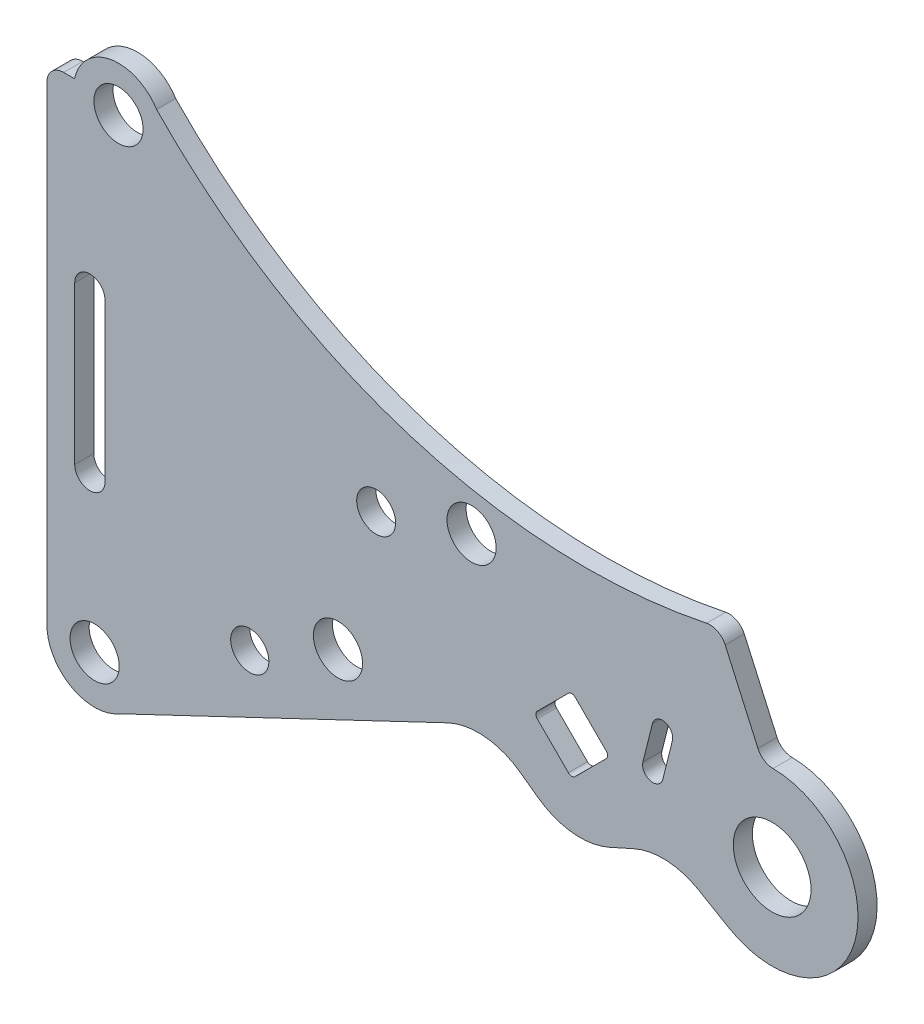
from build123d import *

# Parameters (mm, degrees)
ESQUISSE1_R        = 5.15
ESQUISSE1_R_2      = 4
ESQUISSE1_R_3      = 4.075
ESQUISSE1_R_4      = 8.15
BOSS_EXTRU_1_DEPTH = 4


with BuildPart() as part:
    # Esquisse1 → Boss.-Extru.1 (new body)
    with BuildSketch(Plane.XY):
        with BuildLine():
            Line((134.024125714, -47.930761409), (127.162179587, -32.597013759))
            ThreePointArc((127.162179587, -32.597013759), (125.562018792, -30.910984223), (123.258541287, -30.599212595))
            ThreePointArc((123.258541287, -30.599212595), (61.050766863, -27.623295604), (8, 5))
            ThreePointArc((8, 5), (-1.619204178, 9.293986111), (-9.219544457, 2))
            Line((-9.219544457, 2), (-11.5, 2))
            ThreePointArc((-11.5, 2), (-13.974873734, 0.974873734), (-15, -1.5))
            Line((-15, -1.5), (-15, -100))
            ThreePointArc((-15, -100), (-10, -108.660254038), (0, -108.660254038))
            Line((0, -108.660254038), (68.974988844, -75.820765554))
            ThreePointArc((68.974988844, -75.820765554), (76.779719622, -74.425586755), (84.205431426, -77.203922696))
            Line((84.205431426, -77.203922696), (87.970055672, -79.922817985))
            ThreePointArc((87.970055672, -79.922817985), (95.23527926, -82.685709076), (102.90788414, -81.441452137))
            Line((102.90788414, -81.441452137), (107.954669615, -79.170398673))
            ThreePointArc((107.954669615, -79.170398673), (114.901234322, -77.870096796), (121.672191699, -79.894864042))
            Line((121.672191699, -79.894864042), (127.925537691, -83.545228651))
            ThreePointArc((127.925537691, -83.545228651), (154.351327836, -72.78867647), (137.183202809, -50.000932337))
            ThreePointArc((137.183202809, -50.000932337), (135.300454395, -49.428544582), (134.024125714, -47.930761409))
        make_face()
        Circle(ESQUISSE1_R, mode=Mode.SUBTRACT)
        with Locations((-5, -100)):
            Circle(ESQUISSE1_R, mode=Mode.SUBTRACT)
        with Locations((46, -74)):
            Circle(ESQUISSE1_R, mode=Mode.SUBTRACT)
        with Locations((27.518074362, -83.422158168)):
            Circle(ESQUISSE1_R_2, mode=Mode.SUBTRACT)
        with Locations((54, -45)):
            Circle(ESQUISSE1_R_3, mode=Mode.SUBTRACT)
        with Locations((74, -39)):
            Circle(ESQUISSE1_R, mode=Mode.SUBTRACT)
        with Locations((137, -68)):
            Circle(ESQUISSE1_R_4, mode=Mode.SUBTRACT)
        with BuildLine():
            Line((-9.175, -68), (-9.175, -35))
            ThreePointArc((-9.175, -35), (-6, -31.825), (-2.825, -35))
            Line((-2.825, -35), (-2.825, -68))
            ThreePointArc((-2.825, -68), (-6, -71.175), (-9.175, -68))
        make_face(mode=Mode.SUBTRACT)
        with BuildLine():
            Line((87.787510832, -65.707106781), (94.292893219, -72.212489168))
            ThreePointArc((94.292893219, -72.212489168), (95, -72.505382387), (95.707106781, -72.212489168))
            Line((95.707106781, -72.212489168), (102.212489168, -65.707106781))
            ThreePointArc((102.212489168, -65.707106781), (102.505382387, -65), (102.212489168, -64.292893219))
            Line((102.212489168, -64.292893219), (95.707106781, -57.787510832))
            ThreePointArc((95.707106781, -57.787510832), (95, -57.494617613), (94.292893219, -57.787510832))
            Line((94.292893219, -57.787510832), (87.787510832, -64.292893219))
            ThreePointArc((87.787510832, -64.292893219), (87.494617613, -65), (87.787510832, -65.707106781))
        make_face(mode=Mode.SUBTRACT)
        with BuildLine():
            Line((111.914193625, -54.478548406), (109.914193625, -62.478548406))
            ThreePointArc((109.914193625, -62.478548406), (111.478548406, -65.085806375), (114.085806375, -63.521451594))
            Line((114.085806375, -63.521451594), (116.085806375, -55.521451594))
            ThreePointArc((116.085806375, -55.521451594), (114.521451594, -52.914193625), (111.914193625, -54.478548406))
        make_face(mode=Mode.SUBTRACT)
    extrude(amount=BOSS_EXTRU_1_DEPTH)


solid = part.part
